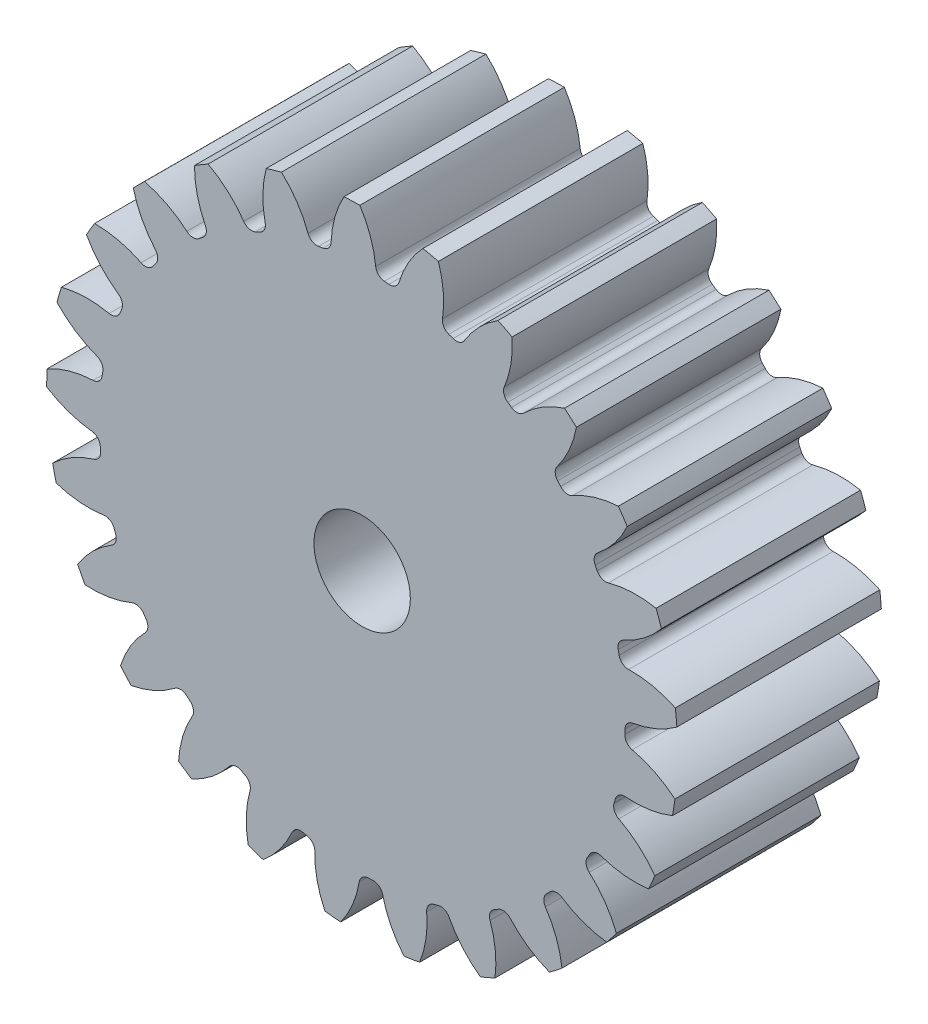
from build123d import *

# Parameters (mm, degrees)
SKETCH3_R         = 137.16
GEARBODY_DEPTH    = 88.9
TOOTHCUT_DEPTH    = 214.375118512
CIRPATTERN1_COUNT = 25
BOREDIA_R         = 20.955
BORE_DEPTH        = 12700


with BuildPart() as part:
    # Sketch3 → gearBody (new body)
    with BuildSketch(Plane.XY):
        Circle(SKETCH3_R)
    extrude(amount=GEARBODY_DEPTH)

    # Sketch2 → toothCut (cut, through all)
    with BuildSketch(Plane.XY):
        with BuildLine():
            ThreePointArc((114.213202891, -4.453569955), (114.247407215, -3.466979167), (114.27308938, -2.480129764))
            ThreePointArc((114.27308938, -2.480129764), (115.278225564, 0.133570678), (117.718330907, 1.507475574))
            ThreePointArc((117.718330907, 1.507475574), (127.939647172, 4.520076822), (137.16, 9.862002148))
            ThreePointArc((137.16, 9.862002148), (137.450814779, -4.171115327), (136.309614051, -18.160776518))
            ThreePointArc((136.309614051, -18.160776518), (127.430143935, -12.269589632), (117.410309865, -8.642745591))
            ThreePointArc((117.410309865, -8.642745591), (115.058003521, -7.123409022), (114.213202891, -4.453569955))
        make_face()
    toothcut = extrude(amount=TOOTHCUT_DEPTH, mode=Mode.SUBTRACT)

    # CirPattern1: toothCut ×25 about axis
    cirpattern1_axis = Axis((0, 0, 0), (0, 0, 1))
    for i in range(1, CIRPATTERN1_COUNT):
        add(toothcut.rotate(cirpattern1_axis, i * 360 / CIRPATTERN1_COUNT), mode=Mode.SUBTRACT)

    # boreDia → bore (cut, symmetric)
    with BuildSketch(Plane.XY):
        Circle(BOREDIA_R)
    extrude(amount=BORE_DEPTH, both=True, mode=Mode.SUBTRACT)


solid = part.part
